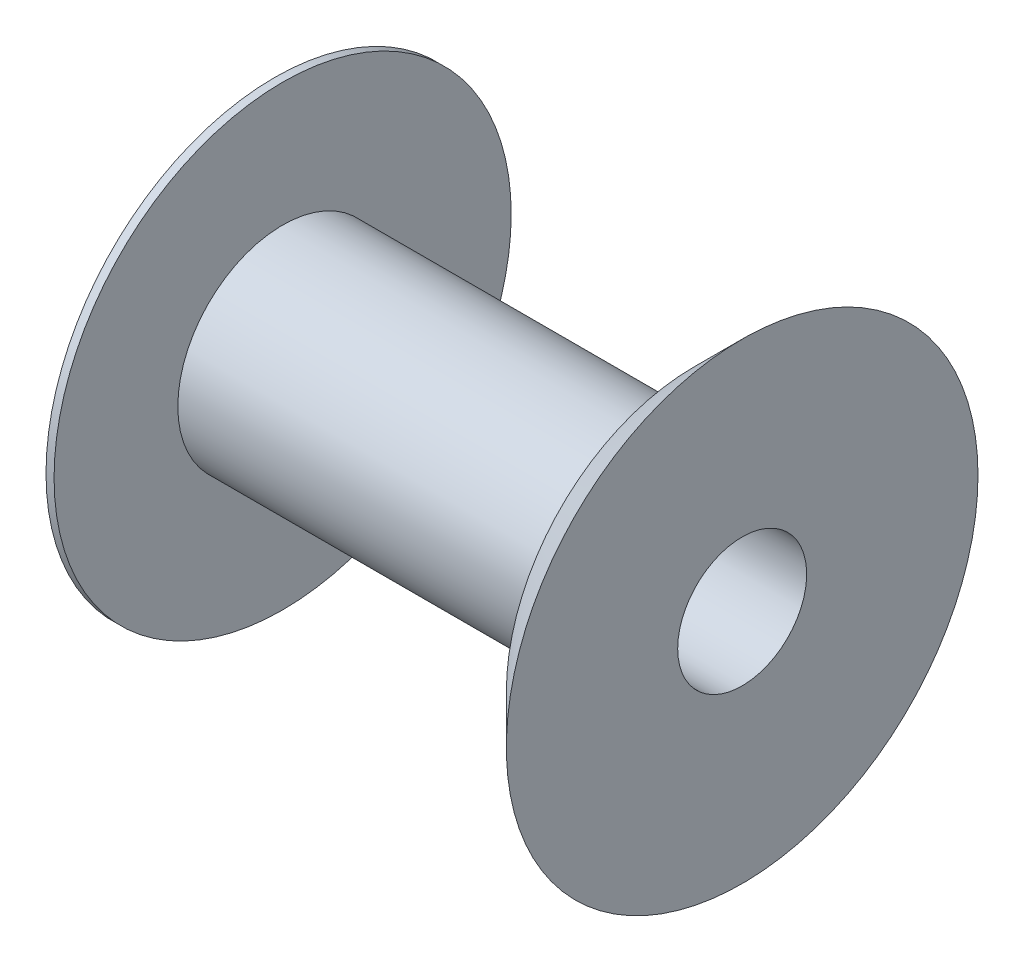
ISO-10303-21;
HEADER;
FILE_DESCRIPTION(('STEP AP214'),'2;1');
FILE_NAME('part.step','',(''),(''),'','','');
FILE_SCHEMA(('AUTOMOTIVE_DESIGN { 1 0 10303 214 1 1 1 1 }'));
ENDSEC;
DATA;
#1=APPLICATION_CONTEXT('core data for automotive mechanical design processes');
#2=APPLICATION_PROTOCOL_DEFINITION('international standard','automotive_design',2000,#1);
#3=PRODUCT_CONTEXT('',#1,'mechanical');
#4=PRODUCT('Part','Part','',(#3));
#5=PRODUCT_RELATED_PRODUCT_CATEGORY('part','',(#4));
#6=PRODUCT_DEFINITION_FORMATION('','',#4);
#7=PRODUCT_DEFINITION_CONTEXT('part definition',#1,'design');
#8=PRODUCT_DEFINITION('design','',#6,#7);
#9=PRODUCT_DEFINITION_SHAPE('','',#8);
#10=(LENGTH_UNIT() NAMED_UNIT(*) SI_UNIT(.MILLI.,.METRE.));
#11=(NAMED_UNIT(*) PLANE_ANGLE_UNIT() SI_UNIT($,.RADIAN.));
#12=(NAMED_UNIT(*) SI_UNIT($,.STERADIAN.) SOLID_ANGLE_UNIT());
#13=UNCERTAINTY_MEASURE_WITH_UNIT(LENGTH_MEASURE(1.E-05),#10,'distance_accuracy_value','');
#14=(GEOMETRIC_REPRESENTATION_CONTEXT(3) GLOBAL_UNCERTAINTY_ASSIGNED_CONTEXT((#13)) GLOBAL_UNIT_ASSIGNED_CONTEXT((#10,
#11,#12)) REPRESENTATION_CONTEXT('',''));
#15=CARTESIAN_POINT('',(0.,0.,0.));
#16=DIRECTION('',(0.,0.,1.));
#17=DIRECTION('',(1.,0.,0.));
#18=AXIS2_PLACEMENT_3D('',#15,#16,#17);
#19=CARTESIAN_POINT('',(-21.,-6.2719198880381,-39.599343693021));
#20=DIRECTION('',(1.,0.,0.));
#21=DIRECTION('',(0.,0.809016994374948,0.587785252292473));
#22=AXIS2_PLACEMENT_3D('',#19,#20,#21);
#23=PLANE('',#22);
#24=CARTESIAN_POINT('',(-21.,0.,0.));
#25=DIRECTION('',(-1.,0.,0.));
#26=DIRECTION('',(0.,0.,1.));
#27=AXIS2_PLACEMENT_3D('',#24,#25,#26);
#28=CIRCLE('',#27,12.9999999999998);
#29=CARTESIAN_POINT('',(-21.,0.,12.9999999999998));
#30=VERTEX_POINT('',#29);
#31=EDGE_CURVE('E62',#30,#30,#28,.T.);
#32=ORIENTED_EDGE('',*,*,#31,.T.);
#33=EDGE_LOOP('',(#32));
#34=FACE_BOUND('',#33,.T.);
#35=CARTESIAN_POINT('',(-21.,0.,0.));
#36=DIRECTION('',(-1.,0.,0.));
#37=DIRECTION('',(0.,0.,1.));
#38=AXIS2_PLACEMENT_3D('',#35,#36,#37);
#39=CIRCLE('',#38,28.3500000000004);
#40=CARTESIAN_POINT('',(-21.,0.,28.3500000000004));
#41=VERTEX_POINT('',#40);
#42=EDGE_CURVE('E67',#41,#41,#39,.F.);
#43=ORIENTED_EDGE('',*,*,#42,.T.);
#44=EDGE_LOOP('',(#43));
#45=FACE_BOUND('',#44,.T.);
#46=ADVANCED_FACE('F15',(#34,#45),#23,.T.);
#47=CARTESIAN_POINT('',(-21.,0.,0.));
#48=DIRECTION('',(-1.,0.,0.));
#49=DIRECTION('',(0.,0.,1.));
#50=AXIS2_PLACEMENT_3D('',#47,#48,#49);
#51=CYLINDRICAL_SURFACE('',#50,28.3500000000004);
#52=ORIENTED_EDGE('',*,*,#42,.F.);
#53=EDGE_LOOP('',(#52));
#54=FACE_BOUND('',#53,.T.);
#55=CARTESIAN_POINT('',(-22.,0.,0.));
#56=DIRECTION('',(-1.,0.,0.));
#57=DIRECTION('',(0.,0.,1.));
#58=AXIS2_PLACEMENT_3D('',#55,#56,#57);
#59=CIRCLE('',#58,28.3500000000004);
#60=CARTESIAN_POINT('',(-22.,0.,28.3500000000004));
#61=VERTEX_POINT('',#60);
#62=EDGE_CURVE('E57',#61,#61,#59,.T.);
#63=ORIENTED_EDGE('',*,*,#62,.F.);
#64=EDGE_LOOP('',(#63));
#65=FACE_BOUND('',#64,.T.);
#66=ADVANCED_FACE('F73',(#54,#65),#51,.T.);
#67=CARTESIAN_POINT('',(30.,0.,0.));
#68=DIRECTION('',(-1.,0.,0.));
#69=DIRECTION('',(0.,0.,1.));
#70=AXIS2_PLACEMENT_3D('',#67,#68,#69);
#71=CYLINDRICAL_SURFACE('',#70,12.9999999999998);
#72=CARTESIAN_POINT('',(30.,0.,0.));
#73=DIRECTION('',(-1.,0.,0.));
#74=DIRECTION('',(0.,0.,1.));
#75=AXIS2_PLACEMENT_3D('',#72,#73,#74);
#76=CIRCLE('',#75,12.9999999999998);
#77=CARTESIAN_POINT('',(30.,0.,12.9999999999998));
#78=VERTEX_POINT('',#77);
#79=EDGE_CURVE('E52',#78,#78,#76,.F.);
#80=ORIENTED_EDGE('',*,*,#79,.F.);
#81=EDGE_LOOP('',(#80));
#82=FACE_BOUND('',#81,.T.);
#83=ORIENTED_EDGE('',*,*,#31,.F.);
#84=EDGE_LOOP('',(#83));
#85=FACE_BOUND('',#84,.T.);
#86=ADVANCED_FACE('F76',(#82,#85),#71,.T.);
#87=CARTESIAN_POINT('',(-22.,-39.599343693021,6.2719198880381));
#88=DIRECTION('',(-1.,0.,0.));
#89=DIRECTION('',(0.,0.809016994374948,0.587785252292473));
#90=AXIS2_PLACEMENT_3D('',#87,#88,#89);
#91=PLANE('',#90);
#92=CARTESIAN_POINT('',(-22.,0.,0.));
#93=DIRECTION('',(-1.,0.,0.));
#94=DIRECTION('',(0.,0.,1.));
#95=AXIS2_PLACEMENT_3D('',#92,#93,#94);
#96=CIRCLE('',#95,24.3500000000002);
#97=CARTESIAN_POINT('',(-22.,0.,24.3500000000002));
#98=VERTEX_POINT('',#97);
#99=EDGE_CURVE('E47',#98,#98,#96,.F.);
#100=ORIENTED_EDGE('',*,*,#99,.T.);
#101=EDGE_LOOP('',(#100));
#102=FACE_BOUND('',#101,.T.);
#103=ORIENTED_EDGE('',*,*,#62,.T.);
#104=EDGE_LOOP('',(#103));
#105=FACE_BOUND('',#104,.T.);
#106=ADVANCED_FACE('F80',(#102,#105),#91,.T.);
#107=CARTESIAN_POINT('',(30.,-32.475652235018,5.1436380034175));
#108=DIRECTION('',(-1.,0.,0.));
#109=DIRECTION('',(0.,0.809016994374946,0.587785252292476));
#110=AXIS2_PLACEMENT_3D('',#107,#108,#109);
#111=PLANE('',#110);
#112=ORIENTED_EDGE('',*,*,#79,.T.);
#113=EDGE_LOOP('',(#112));
#114=FACE_BOUND('',#113,.T.);
#115=CARTESIAN_POINT('',(30.,0.,0.));
#116=DIRECTION('',(1.,0.,0.));
#117=DIRECTION('',(0.,0.,-1.));
#118=AXIS2_PLACEMENT_3D('',#115,#116,#117);
#119=CIRCLE('',#118,23.2500000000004);
#120=CARTESIAN_POINT('',(30.,0.,-23.2500000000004));
#121=VERTEX_POINT('',#120);
#122=EDGE_CURVE('E42',#121,#121,#119,.F.);
#123=ORIENTED_EDGE('',*,*,#122,.T.);
#124=EDGE_LOOP('',(#123));
#125=FACE_BOUND('',#124,.T.);
#126=ADVANCED_FACE('F82',(#114,#125),#111,.T.);
#127=CARTESIAN_POINT('',(-22.,0.,0.));
#128=DIRECTION('',(-1.,0.,0.));
#129=DIRECTION('',(0.,0.,1.));
#130=AXIS2_PLACEMENT_3D('',#127,#128,#129);
#131=CYLINDRICAL_SURFACE('',#130,24.3500000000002);
#132=ORIENTED_EDGE('',*,*,#99,.F.);
#133=EDGE_LOOP('',(#132));
#134=FACE_BOUND('',#133,.T.);
#135=CARTESIAN_POINT('',(-22.5,0.,0.));
#136=DIRECTION('',(-1.,0.,0.));
#137=DIRECTION('',(0.,0.,1.));
#138=AXIS2_PLACEMENT_3D('',#135,#136,#137);
#139=CIRCLE('',#138,24.3500000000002);
#140=CARTESIAN_POINT('',(-22.5,0.,24.3500000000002));
#141=VERTEX_POINT('',#140);
#142=EDGE_CURVE('E37',#141,#141,#139,.T.);
#143=ORIENTED_EDGE('',*,*,#142,.F.);
#144=EDGE_LOOP('',(#143));
#145=FACE_BOUND('',#144,.T.);
#146=ADVANCED_FACE('F90',(#134,#145),#131,.T.);
#147=CARTESIAN_POINT('',(36.,0.,0.));
#148=DIRECTION('',(1.,0.,0.));
#149=DIRECTION('',(0.,0.,-1.));
#150=AXIS2_PLACEMENT_3D('',#147,#148,#149);
#151=CONICAL_SURFACE('',#150,29.2499999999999,0.785398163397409);
#152=CARTESIAN_POINT('',(36.,0.,0.));
#153=DIRECTION('',(1.,0.,0.));
#154=DIRECTION('',(0.,0.,-1.));
#155=AXIS2_PLACEMENT_3D('',#152,#153,#154);
#156=CIRCLE('',#155,29.2499999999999);
#157=CARTESIAN_POINT('',(36.,0.,-29.2499999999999));
#158=VERTEX_POINT('',#157);
#159=EDGE_CURVE('E28',#158,#158,#156,.T.);
#160=ORIENTED_EDGE('',*,*,#159,.F.);
#161=EDGE_LOOP('',(#160));
#162=FACE_BOUND('',#161,.T.);
#163=ORIENTED_EDGE('',*,*,#122,.F.);
#164=EDGE_LOOP('',(#163));
#165=FACE_BOUND('',#164,.T.);
#166=ADVANCED_FACE('F106',(#162,#165),#151,.T.);
#167=CARTESIAN_POINT('',(-22.5,-34.012134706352,5.3869929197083));
#168=DIRECTION('',(-1.,0.,0.));
#169=DIRECTION('',(0.,0.809016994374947,0.587785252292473));
#170=AXIS2_PLACEMENT_3D('',#167,#168,#169);
#171=PLANE('',#170);
#172=CARTESIAN_POINT('',(-22.5,0.,0.));
#173=DIRECTION('',(-1.,0.,0.));
#174=DIRECTION('',(0.,0.,1.));
#175=AXIS2_PLACEMENT_3D('',#172,#173,#174);
#176=CIRCLE('',#175,8.00000000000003);
#177=CARTESIAN_POINT('',(-22.5,0.,8.00000000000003));
#178=VERTEX_POINT('',#177);
#179=EDGE_CURVE('E23',#178,#178,#176,.T.);
#180=ORIENTED_EDGE('',*,*,#179,.F.);
#181=EDGE_LOOP('',(#180));
#182=FACE_BOUND('',#181,.T.);
#183=ORIENTED_EDGE('',*,*,#142,.T.);
#184=EDGE_LOOP('',(#183));
#185=FACE_BOUND('',#184,.T.);
#186=ADVANCED_FACE('F103',(#182,#185),#171,.T.);
#187=CARTESIAN_POINT('',(36.,-6.4710284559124,-40.856465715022));
#188=DIRECTION('',(1.,0.,0.));
#189=DIRECTION('',(0.,0.809016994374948,0.587785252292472));
#190=AXIS2_PLACEMENT_3D('',#187,#188,#189);
#191=PLANE('',#190);
#192=CARTESIAN_POINT('',(36.,0.,0.));
#193=DIRECTION('',(-1.,0.,0.));
#194=DIRECTION('',(0.,0.,1.));
#195=AXIS2_PLACEMENT_3D('',#192,#193,#194);
#196=CIRCLE('',#195,8.00000000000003);
#197=CARTESIAN_POINT('',(36.,0.,8.00000000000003));
#198=VERTEX_POINT('',#197);
#199=EDGE_CURVE('E10',#198,#198,#196,.F.);
#200=ORIENTED_EDGE('',*,*,#199,.F.);
#201=EDGE_LOOP('',(#200));
#202=FACE_BOUND('',#201,.T.);
#203=ORIENTED_EDGE('',*,*,#159,.T.);
#204=EDGE_LOOP('',(#203));
#205=FACE_BOUND('',#204,.T.);
#206=ADVANCED_FACE('F17',(#202,#205),#191,.T.);
#207=CARTESIAN_POINT('',(36.,0.,0.));
#208=DIRECTION('',(-1.,0.,0.));
#209=DIRECTION('',(0.,0.,1.));
#210=AXIS2_PLACEMENT_3D('',#207,#208,#209);
#211=CYLINDRICAL_SURFACE('',#210,8.00000000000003);
#212=ORIENTED_EDGE('',*,*,#179,.T.);
#213=EDGE_LOOP('',(#212));
#214=FACE_BOUND('',#213,.T.);
#215=ORIENTED_EDGE('',*,*,#199,.T.);
#216=EDGE_LOOP('',(#215));
#217=FACE_BOUND('',#216,.T.);
#218=ADVANCED_FACE('F96',(#214,#217),#211,.F.);
#219=CLOSED_SHELL('',(#46,#66,#86,#106,#126,#146,#166,#186,#206,#218));
#220=MANIFOLD_SOLID_BREP('B1',#219);
#221=ADVANCED_BREP_SHAPE_REPRESENTATION('',(#18,#220),#14);
#222=SHAPE_DEFINITION_REPRESENTATION(#9,#221);
ENDSEC;
END-ISO-10303-21;
